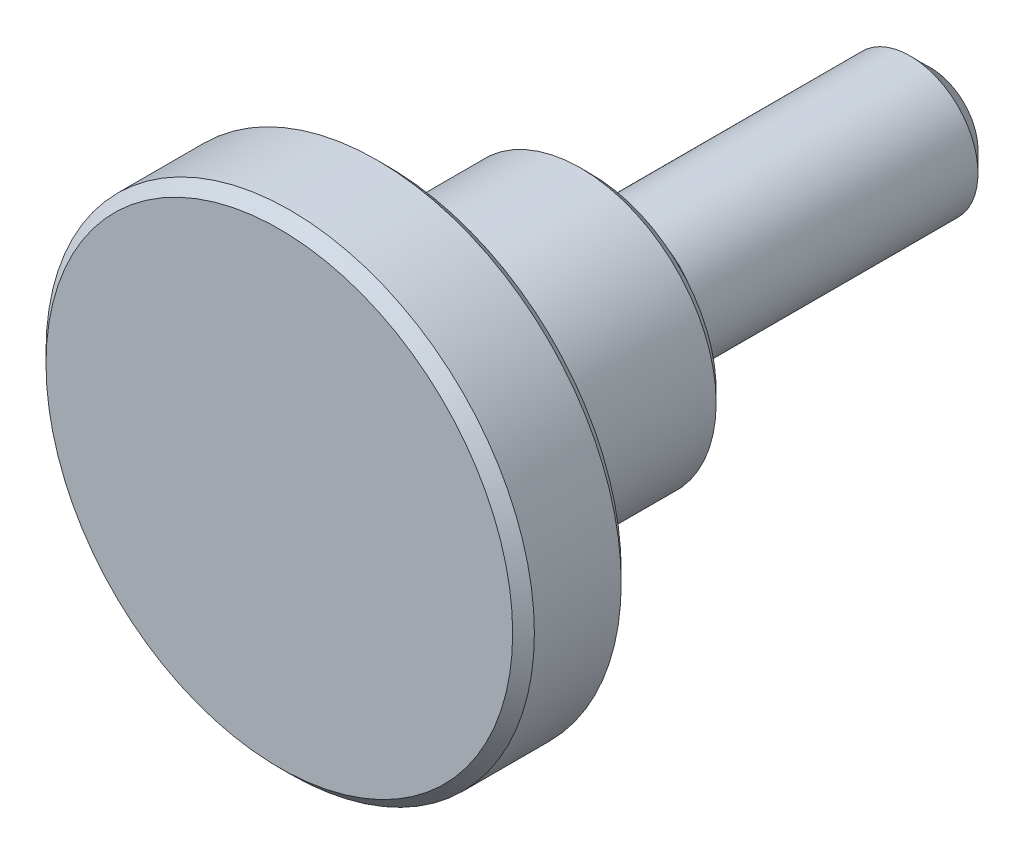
ISO-10303-21;
HEADER;
FILE_DESCRIPTION(('STEP AP214'),'2;1');
FILE_NAME('part.step','',(''),(''),'','','');
FILE_SCHEMA(('AUTOMOTIVE_DESIGN { 1 0 10303 214 1 1 1 1 }'));
ENDSEC;
DATA;
#1=APPLICATION_CONTEXT('core data for automotive mechanical design processes');
#2=APPLICATION_PROTOCOL_DEFINITION('international standard','automotive_design',2000,#1);
#3=PRODUCT_CONTEXT('',#1,'mechanical');
#4=PRODUCT('Part','Part','',(#3));
#5=PRODUCT_RELATED_PRODUCT_CATEGORY('part','',(#4));
#6=PRODUCT_DEFINITION_FORMATION('','',#4);
#7=PRODUCT_DEFINITION_CONTEXT('part definition',#1,'design');
#8=PRODUCT_DEFINITION('design','',#6,#7);
#9=PRODUCT_DEFINITION_SHAPE('','',#8);
#10=(LENGTH_UNIT() NAMED_UNIT(*) SI_UNIT(.MILLI.,.METRE.));
#11=(NAMED_UNIT(*) PLANE_ANGLE_UNIT() SI_UNIT($,.RADIAN.));
#12=(NAMED_UNIT(*) SI_UNIT($,.STERADIAN.) SOLID_ANGLE_UNIT());
#13=UNCERTAINTY_MEASURE_WITH_UNIT(LENGTH_MEASURE(1.E-05),#10,'distance_accuracy_value','');
#14=(GEOMETRIC_REPRESENTATION_CONTEXT(3) GLOBAL_UNCERTAINTY_ASSIGNED_CONTEXT((#13)) GLOBAL_UNIT_ASSIGNED_CONTEXT((#10,
#11,#12)) REPRESENTATION_CONTEXT('',''));
#15=CARTESIAN_POINT('',(0.,0.,0.));
#16=DIRECTION('',(0.,0.,1.));
#17=DIRECTION('',(1.,0.,0.));
#18=AXIS2_PLACEMENT_3D('',#15,#16,#17);
#19=CARTESIAN_POINT('',(0.,3.5,-25.));
#20=DIRECTION('',(0.,0.,-1.));
#21=DIRECTION('',(-1.,0.,0.));
#22=AXIS2_PLACEMENT_3D('',#19,#20,#21);
#23=PLANE('',#22);
#24=CARTESIAN_POINT('',(0.,0.,-25.));
#25=DIRECTION('',(0.,0.,-1.));
#26=DIRECTION('',(-1.,0.,0.));
#27=AXIS2_PLACEMENT_3D('',#24,#25,#26);
#28=CIRCLE('',#27,3.5);
#29=CARTESIAN_POINT('',(-3.5,0.,-25.));
#30=VERTEX_POINT('',#29);
#31=EDGE_CURVE('E8',#30,#30,#28,.T.);
#32=ORIENTED_EDGE('',*,*,#31,.T.);
#33=EDGE_LOOP('',(#32));
#34=FACE_BOUND('',#33,.T.);
#35=ADVANCED_FACE('F12',(#34),#23,.T.);
#36=CARTESIAN_POINT('',(0.,0.,-25.));
#37=DIRECTION('',(0.,0.,1.));
#38=DIRECTION('',(1.,0.,0.));
#39=AXIS2_PLACEMENT_3D('',#36,#37,#38);
#40=CONICAL_SURFACE('',#39,3.5,0.785398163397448);
#41=CARTESIAN_POINT('',(0.,0.,-23.5));
#42=DIRECTION('',(0.,0.,-1.));
#43=DIRECTION('',(-1.,0.,0.));
#44=AXIS2_PLACEMENT_3D('',#41,#42,#43);
#45=CIRCLE('',#44,5.);
#46=CARTESIAN_POINT('',(-5.,0.,-23.5));
#47=VERTEX_POINT('',#46);
#48=EDGE_CURVE('E18',#47,#47,#45,.T.);
#49=ORIENTED_EDGE('',*,*,#48,.T.);
#50=EDGE_LOOP('',(#49));
#51=FACE_BOUND('',#50,.T.);
#52=ORIENTED_EDGE('',*,*,#31,.F.);
#53=EDGE_LOOP('',(#52));
#54=FACE_BOUND('',#53,.T.);
#55=ADVANCED_FACE('F79',(#51,#54),#40,.T.);
#56=CARTESIAN_POINT('',(0.,0.,-30.));
#57=DIRECTION('',(0.,0.,-1.));
#58=DIRECTION('',(-1.,0.,0.));
#59=AXIS2_PLACEMENT_3D('',#56,#57,#58);
#60=CYLINDRICAL_SURFACE('',#59,5.);
#61=CARTESIAN_POINT('',(0.,0.,-3.));
#62=DIRECTION('',(0.,0.,-1.));
#63=DIRECTION('',(-1.,0.,0.));
#64=AXIS2_PLACEMENT_3D('',#61,#62,#63);
#65=CIRCLE('',#64,5.);
#66=CARTESIAN_POINT('',(-5.,0.,-3.));
#67=VERTEX_POINT('',#66);
#68=EDGE_CURVE('E22',#67,#67,#65,.T.);
#69=ORIENTED_EDGE('',*,*,#68,.T.);
#70=EDGE_LOOP('',(#69));
#71=FACE_BOUND('',#70,.T.);
#72=ORIENTED_EDGE('',*,*,#48,.F.);
#73=EDGE_LOOP('',(#72));
#74=FACE_BOUND('',#73,.T.);
#75=ADVANCED_FACE('F84',(#71,#74),#60,.T.);
#76=CARTESIAN_POINT('',(0.,5.,-3.));
#77=DIRECTION('',(0.,0.,1.));
#78=DIRECTION('',(1.,0.,0.));
#79=AXIS2_PLACEMENT_3D('',#76,#77,#78);
#80=PLANE('',#79);
#81=CARTESIAN_POINT('',(0.,0.,-3.));
#82=DIRECTION('',(0.,0.,-1.));
#83=DIRECTION('',(-1.,0.,0.));
#84=AXIS2_PLACEMENT_3D('',#81,#82,#83);
#85=CIRCLE('',#84,4.65000000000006);
#86=CARTESIAN_POINT('',(-4.65000000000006,0.,-3.));
#87=VERTEX_POINT('',#86);
#88=EDGE_CURVE('E26',#87,#87,#85,.T.);
#89=ORIENTED_EDGE('',*,*,#88,.T.);
#90=EDGE_LOOP('',(#89));
#91=FACE_BOUND('',#90,.T.);
#92=ORIENTED_EDGE('',*,*,#68,.F.);
#93=EDGE_LOOP('',(#92));
#94=FACE_BOUND('',#93,.T.);
#95=ADVANCED_FACE('F89',(#91,#94),#80,.T.);
#96=CARTESIAN_POINT('',(0.,0.,-2.2));
#97=DIRECTION('',(0.,0.,-1.));
#98=DIRECTION('',(-1.,0.,0.));
#99=AXIS2_PLACEMENT_3D('',#96,#97,#98);
#100=TOROIDAL_SURFACE('',#99,4.65,0.8);
#101=CARTESIAN_POINT('',(0.,0.,-2.2));
#102=DIRECTION('',(0.,0.,-1.));
#103=DIRECTION('',(-1.,0.,0.));
#104=AXIS2_PLACEMENT_3D('',#101,#102,#103);
#105=CIRCLE('',#104,3.85);
#106=CARTESIAN_POINT('',(-3.85,0.,-2.2));
#107=VERTEX_POINT('',#106);
#108=EDGE_CURVE('E31',#107,#107,#105,.T.);
#109=ORIENTED_EDGE('',*,*,#108,.T.);
#110=EDGE_LOOP('',(#109));
#111=FACE_BOUND('',#110,.T.);
#112=ORIENTED_EDGE('',*,*,#88,.F.);
#113=EDGE_LOOP('',(#112));
#114=FACE_BOUND('',#113,.T.);
#115=ADVANCED_FACE('F96',(#111,#114),#100,.F.);
#116=CARTESIAN_POINT('',(0.,0.,-30.));
#117=DIRECTION('',(0.,0.,-1.));
#118=DIRECTION('',(-1.,0.,0.));
#119=AXIS2_PLACEMENT_3D('',#116,#117,#118);
#120=CYLINDRICAL_SURFACE('',#119,3.85);
#121=CARTESIAN_POINT('',(0.,0.,-0.800000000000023));
#122=DIRECTION('',(0.,0.,-1.));
#123=DIRECTION('',(-1.,0.,0.));
#124=AXIS2_PLACEMENT_3D('',#121,#122,#123);
#125=CIRCLE('',#124,3.85);
#126=CARTESIAN_POINT('',(-3.85,0.,-0.800000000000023));
#127=VERTEX_POINT('',#126);
#128=EDGE_CURVE('E34',#127,#127,#125,.T.);
#129=ORIENTED_EDGE('',*,*,#128,.T.);
#130=EDGE_LOOP('',(#129));
#131=FACE_BOUND('',#130,.T.);
#132=ORIENTED_EDGE('',*,*,#108,.F.);
#133=EDGE_LOOP('',(#132));
#134=FACE_BOUND('',#133,.T.);
#135=ADVANCED_FACE('F100',(#131,#134),#120,.T.);
#136=CARTESIAN_POINT('',(0.,0.,-0.800000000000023));
#137=DIRECTION('',(0.,0.,-1.));
#138=DIRECTION('',(-1.,0.,0.));
#139=AXIS2_PLACEMENT_3D('',#136,#137,#138);
#140=TOROIDAL_SURFACE('',#139,4.65,0.8);
#141=CARTESIAN_POINT('',(0.,0.,0.));
#142=DIRECTION('',(0.,0.,-1.));
#143=DIRECTION('',(-1.,0.,0.));
#144=AXIS2_PLACEMENT_3D('',#141,#142,#143);
#145=CIRCLE('',#144,4.65000000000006);
#146=CARTESIAN_POINT('',(-4.65000000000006,0.,0.));
#147=VERTEX_POINT('',#146);
#148=EDGE_CURVE('E37',#147,#147,#145,.T.);
#149=ORIENTED_EDGE('',*,*,#148,.T.);
#150=EDGE_LOOP('',(#149));
#151=FACE_BOUND('',#150,.T.);
#152=ORIENTED_EDGE('',*,*,#128,.F.);
#153=EDGE_LOOP('',(#152));
#154=FACE_BOUND('',#153,.T.);
#155=ADVANCED_FACE('F104',(#151,#154),#140,.F.);
#156=CARTESIAN_POINT('',(0.,9.2,0.));
#157=DIRECTION('',(0.,0.,-1.));
#158=DIRECTION('',(-1.,0.,0.));
#159=AXIS2_PLACEMENT_3D('',#156,#157,#158);
#160=PLANE('',#159);
#161=CARTESIAN_POINT('',(0.,0.,0.));
#162=DIRECTION('',(0.,0.,-1.));
#163=DIRECTION('',(-1.,0.,0.));
#164=AXIS2_PLACEMENT_3D('',#161,#162,#163);
#165=CIRCLE('',#164,9.2);
#166=CARTESIAN_POINT('',(-9.2,0.,0.));
#167=VERTEX_POINT('',#166);
#168=EDGE_CURVE('E40',#167,#167,#165,.T.);
#169=ORIENTED_EDGE('',*,*,#168,.T.);
#170=EDGE_LOOP('',(#169));
#171=FACE_BOUND('',#170,.T.);
#172=ORIENTED_EDGE('',*,*,#148,.F.);
#173=EDGE_LOOP('',(#172));
#174=FACE_BOUND('',#173,.T.);
#175=ADVANCED_FACE('F108',(#171,#174),#160,.T.);
#176=CARTESIAN_POINT('',(0.,0.,0.));
#177=DIRECTION('',(0.,0.,1.));
#178=DIRECTION('',(1.,0.,0.));
#179=AXIS2_PLACEMENT_3D('',#176,#177,#178);
#180=CONICAL_SURFACE('',#179,9.2,0.785398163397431);
#181=CARTESIAN_POINT('',(0.,0.,0.800000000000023));
#182=DIRECTION('',(0.,0.,-1.));
#183=DIRECTION('',(-1.,0.,0.));
#184=AXIS2_PLACEMENT_3D('',#181,#182,#183);
#185=CIRCLE('',#184,10.);
#186=CARTESIAN_POINT('',(-10.,0.,0.800000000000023));
#187=VERTEX_POINT('',#186);
#188=EDGE_CURVE('E43',#187,#187,#185,.T.);
#189=ORIENTED_EDGE('',*,*,#188,.T.);
#190=EDGE_LOOP('',(#189));
#191=FACE_BOUND('',#190,.T.);
#192=ORIENTED_EDGE('',*,*,#168,.F.);
#193=EDGE_LOOP('',(#192));
#194=FACE_BOUND('',#193,.T.);
#195=ADVANCED_FACE('F112',(#191,#194),#180,.T.);
#196=CARTESIAN_POINT('',(0.,0.,-30.));
#197=DIRECTION('',(0.,0.,-1.));
#198=DIRECTION('',(-1.,0.,0.));
#199=AXIS2_PLACEMENT_3D('',#196,#197,#198);
#200=CYLINDRICAL_SURFACE('',#199,10.);
#201=CARTESIAN_POINT('',(0.,0.,13.));
#202=DIRECTION('',(0.,0.,-1.));
#203=DIRECTION('',(-1.,0.,0.));
#204=AXIS2_PLACEMENT_3D('',#201,#202,#203);
#205=CIRCLE('',#204,10.);
#206=CARTESIAN_POINT('',(-10.,0.,13.));
#207=VERTEX_POINT('',#206);
#208=EDGE_CURVE('E46',#207,#207,#205,.T.);
#209=ORIENTED_EDGE('',*,*,#208,.T.);
#210=EDGE_LOOP('',(#209));
#211=FACE_BOUND('',#210,.T.);
#212=ORIENTED_EDGE('',*,*,#188,.F.);
#213=EDGE_LOOP('',(#212));
#214=FACE_BOUND('',#213,.T.);
#215=ADVANCED_FACE('F116',(#211,#214),#200,.T.);
#216=CARTESIAN_POINT('',(0.,0.,13.));
#217=DIRECTION('',(0.,0.,-1.));
#218=DIRECTION('',(-1.,0.,0.));
#219=AXIS2_PLACEMENT_3D('',#216,#217,#218);
#220=TOROIDAL_SURFACE('',#219,12.,2.);
#221=CARTESIAN_POINT('',(0.,0.,15.));
#222=DIRECTION('',(0.,0.,-1.));
#223=DIRECTION('',(-1.,0.,0.));
#224=AXIS2_PLACEMENT_3D('',#221,#222,#223);
#225=CIRCLE('',#224,12.);
#226=CARTESIAN_POINT('',(-12.,0.,15.));
#227=VERTEX_POINT('',#226);
#228=EDGE_CURVE('E49',#227,#227,#225,.T.);
#229=ORIENTED_EDGE('',*,*,#228,.T.);
#230=EDGE_LOOP('',(#229));
#231=FACE_BOUND('',#230,.T.);
#232=ORIENTED_EDGE('',*,*,#208,.F.);
#233=EDGE_LOOP('',(#232));
#234=FACE_BOUND('',#233,.T.);
#235=ADVANCED_FACE('F120',(#231,#234),#220,.F.);
#236=CARTESIAN_POINT('',(0.,17.2,15.));
#237=DIRECTION('',(0.,0.,-1.));
#238=DIRECTION('',(-1.,0.,0.));
#239=AXIS2_PLACEMENT_3D('',#236,#237,#238);
#240=PLANE('',#239);
#241=CARTESIAN_POINT('',(0.,0.,15.));
#242=DIRECTION('',(0.,0.,-1.));
#243=DIRECTION('',(-1.,0.,0.));
#244=AXIS2_PLACEMENT_3D('',#241,#242,#243);
#245=CIRCLE('',#244,17.2);
#246=CARTESIAN_POINT('',(-17.2,0.,15.));
#247=VERTEX_POINT('',#246);
#248=EDGE_CURVE('E52',#247,#247,#245,.T.);
#249=ORIENTED_EDGE('',*,*,#248,.T.);
#250=EDGE_LOOP('',(#249));
#251=FACE_BOUND('',#250,.T.);
#252=ORIENTED_EDGE('',*,*,#228,.F.);
#253=EDGE_LOOP('',(#252));
#254=FACE_BOUND('',#253,.T.);
#255=ADVANCED_FACE('F124',(#251,#254),#240,.T.);
#256=CARTESIAN_POINT('',(0.,0.,15.));
#257=DIRECTION('',(0.,0.,1.));
#258=DIRECTION('',(1.,0.,0.));
#259=AXIS2_PLACEMENT_3D('',#256,#257,#258);
#260=CONICAL_SURFACE('',#259,17.2,0.785398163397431);
#261=CARTESIAN_POINT('',(0.,0.,15.8));
#262=DIRECTION('',(0.,0.,-1.));
#263=DIRECTION('',(-1.,0.,0.));
#264=AXIS2_PLACEMENT_3D('',#261,#262,#263);
#265=CIRCLE('',#264,18.);
#266=CARTESIAN_POINT('',(-18.,0.,15.8));
#267=VERTEX_POINT('',#266);
#268=EDGE_CURVE('E55',#267,#267,#265,.T.);
#269=ORIENTED_EDGE('',*,*,#268,.T.);
#270=EDGE_LOOP('',(#269));
#271=FACE_BOUND('',#270,.T.);
#272=ORIENTED_EDGE('',*,*,#248,.F.);
#273=EDGE_LOOP('',(#272));
#274=FACE_BOUND('',#273,.T.);
#275=ADVANCED_FACE('F128',(#271,#274),#260,.T.);
#276=CARTESIAN_POINT('',(0.,0.,-30.));
#277=DIRECTION('',(0.,0.,-1.));
#278=DIRECTION('',(-1.,0.,0.));
#279=AXIS2_PLACEMENT_3D('',#276,#277,#278);
#280=CYLINDRICAL_SURFACE('',#279,18.);
#281=CARTESIAN_POINT('',(0.,0.,22.2));
#282=DIRECTION('',(0.,0.,-1.));
#283=DIRECTION('',(-1.,0.,0.));
#284=AXIS2_PLACEMENT_3D('',#281,#282,#283);
#285=CIRCLE('',#284,18.);
#286=CARTESIAN_POINT('',(-18.,0.,22.2));
#287=VERTEX_POINT('',#286);
#288=EDGE_CURVE('E58',#287,#287,#285,.T.);
#289=ORIENTED_EDGE('',*,*,#288,.T.);
#290=EDGE_LOOP('',(#289));
#291=FACE_BOUND('',#290,.T.);
#292=ORIENTED_EDGE('',*,*,#268,.F.);
#293=EDGE_LOOP('',(#292));
#294=FACE_BOUND('',#293,.T.);
#295=ADVANCED_FACE('F76',(#291,#294),#280,.T.);
#296=CARTESIAN_POINT('',(0.,0.,22.2));
#297=DIRECTION('',(0.,0.,-1.));
#298=DIRECTION('',(-1.,0.,0.));
#299=AXIS2_PLACEMENT_3D('',#296,#297,#298);
#300=CONICAL_SURFACE('',#299,18.,0.785398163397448);
#301=CARTESIAN_POINT('',(0.,0.,23.));
#302=DIRECTION('',(0.,0.,-1.));
#303=DIRECTION('',(-1.,0.,0.));
#304=AXIS2_PLACEMENT_3D('',#301,#302,#303);
#305=CIRCLE('',#304,17.2);
#306=CARTESIAN_POINT('',(-17.2,0.,23.));
#307=VERTEX_POINT('',#306);
#308=EDGE_CURVE('E61',#307,#307,#305,.T.);
#309=ORIENTED_EDGE('',*,*,#308,.T.);
#310=EDGE_LOOP('',(#309));
#311=FACE_BOUND('',#310,.T.);
#312=ORIENTED_EDGE('',*,*,#288,.F.);
#313=EDGE_LOOP('',(#312));
#314=FACE_BOUND('',#313,.T.);
#315=ADVANCED_FACE('F65',(#311,#314),#300,.T.);
#316=CARTESIAN_POINT('',(0.,17.2,23.));
#317=DIRECTION('',(0.,0.,1.));
#318=DIRECTION('',(1.,0.,0.));
#319=AXIS2_PLACEMENT_3D('',#316,#317,#318);
#320=PLANE('',#319);
#321=ORIENTED_EDGE('',*,*,#308,.F.);
#322=EDGE_LOOP('',(#321));
#323=FACE_BOUND('',#322,.T.);
#324=ADVANCED_FACE('F68',(#323),#320,.T.);
#325=CLOSED_SHELL('',(#35,#55,#75,#95,#115,#135,#155,#175,#195,#215,#235,#255,#275,#295,#315,#324));
#326=MANIFOLD_SOLID_BREP('B1',#325);
#327=ADVANCED_BREP_SHAPE_REPRESENTATION('',(#18,#326),#14);
#328=SHAPE_DEFINITION_REPRESENTATION(#9,#327);
ENDSEC;
END-ISO-10303-21;
